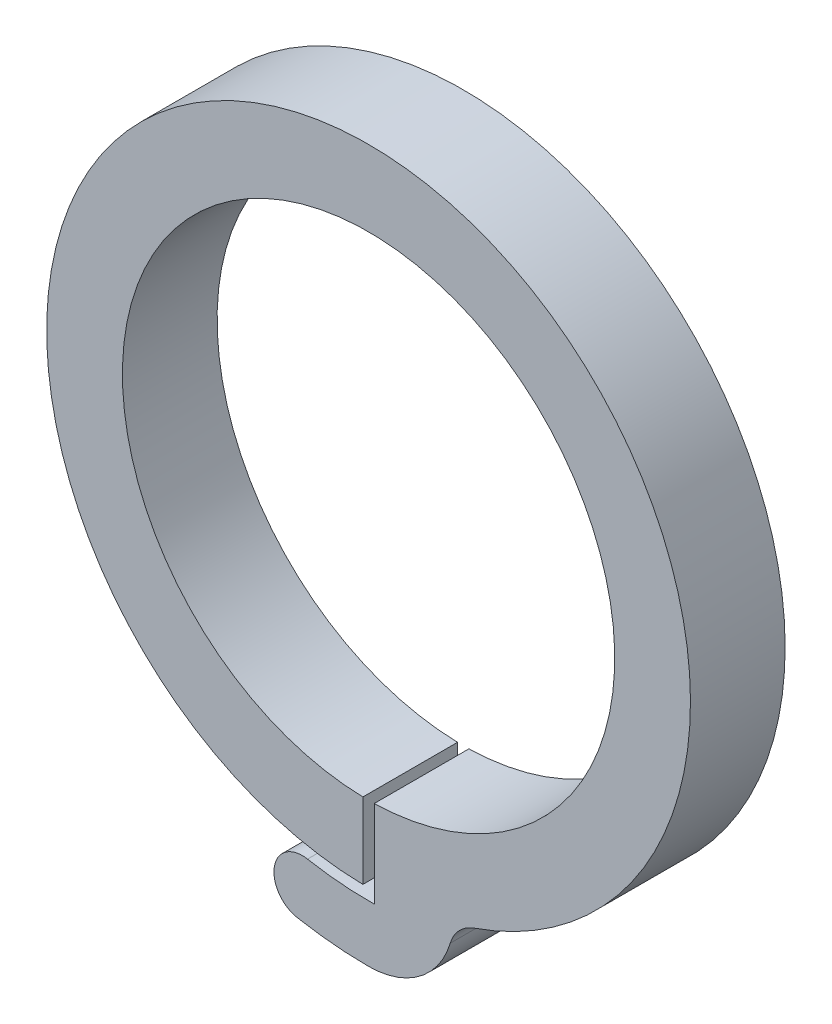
ISO-10303-21;
HEADER;
FILE_DESCRIPTION(('STEP AP214'),'2;1');
FILE_NAME('part.step','',(''),(''),'','','');
FILE_SCHEMA(('AUTOMOTIVE_DESIGN { 1 0 10303 214 1 1 1 1 }'));
ENDSEC;
DATA;
#1=APPLICATION_CONTEXT('core data for automotive mechanical design processes');
#2=APPLICATION_PROTOCOL_DEFINITION('international standard','automotive_design',2000,#1);
#3=PRODUCT_CONTEXT('',#1,'mechanical');
#4=PRODUCT('Part','Part','',(#3));
#5=PRODUCT_RELATED_PRODUCT_CATEGORY('part','',(#4));
#6=PRODUCT_DEFINITION_FORMATION('','',#4);
#7=PRODUCT_DEFINITION_CONTEXT('part definition',#1,'design');
#8=PRODUCT_DEFINITION('design','',#6,#7);
#9=PRODUCT_DEFINITION_SHAPE('','',#8);
#10=(LENGTH_UNIT() NAMED_UNIT(*) SI_UNIT(.MILLI.,.METRE.));
#11=(NAMED_UNIT(*) PLANE_ANGLE_UNIT() SI_UNIT($,.RADIAN.));
#12=(NAMED_UNIT(*) SI_UNIT($,.STERADIAN.) SOLID_ANGLE_UNIT());
#13=UNCERTAINTY_MEASURE_WITH_UNIT(LENGTH_MEASURE(1.E-05),#10,'distance_accuracy_value','');
#14=(GEOMETRIC_REPRESENTATION_CONTEXT(3) GLOBAL_UNCERTAINTY_ASSIGNED_CONTEXT((#13)) GLOBAL_UNIT_ASSIGNED_CONTEXT((#10,
#11,#12)) REPRESENTATION_CONTEXT('',''));
#15=CARTESIAN_POINT('',(0.,0.,0.));
#16=DIRECTION('',(0.,0.,1.));
#17=DIRECTION('',(1.,0.,0.));
#18=AXIS2_PLACEMENT_3D('',#15,#16,#17);
#19=CARTESIAN_POINT('',(-3.5,-18.7743601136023,2.5));
#20=DIRECTION('',(0.,0.,-1.));
#21=DIRECTION('',(-1.,0.,0.));
#22=AXIS2_PLACEMENT_3D('',#19,#20,#21);
#23=CYLINDRICAL_SURFACE('',#22,1.49872143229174);
#24=CARTESIAN_POINT('',(-3.5,-18.7743601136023,-2.5));
#25=DIRECTION('',(0.,0.,1.));
#26=DIRECTION('',(1.,0.,0.));
#27=AXIS2_PLACEMENT_3D('',#24,#25,#26);
#28=CIRCLE('',#27,1.49872143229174);
#29=CARTESIAN_POINT('',(-3.2253337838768,-17.3010222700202,-2.5));
#30=VERTEX_POINT('',#29);
#31=CARTESIAN_POINT('',(-3.77466621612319,-20.2476979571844,-2.5));
#32=VERTEX_POINT('',#31);
#33=EDGE_CURVE('E134',#30,#32,#28,.T.);
#34=ORIENTED_EDGE('',*,*,#33,.T.);
#35=DIRECTION('',(0.,0.,-1.));
#36=VECTOR('',#35,1.);
#37=CARTESIAN_POINT('',(-3.77466621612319,-20.2476979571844,2.5));
#38=LINE('',#37,#36);
#39=CARTESIAN_POINT('',(-3.77466621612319,-20.2476979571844,2.5));
#40=VERTEX_POINT('',#39);
#41=EDGE_CURVE('E11',#40,#32,#38,.T.);
#42=ORIENTED_EDGE('',*,*,#41,.F.);
#43=CARTESIAN_POINT('',(-3.5,-18.7743601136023,2.5));
#44=DIRECTION('',(0.,0.,1.));
#45=DIRECTION('',(1.,0.,0.));
#46=AXIS2_PLACEMENT_3D('',#43,#44,#45);
#47=CIRCLE('',#46,1.49872143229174);
#48=CARTESIAN_POINT('',(-3.2253337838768,-17.3010222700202,2.5));
#49=VERTEX_POINT('',#48);
#50=EDGE_CURVE('E150',#49,#40,#47,.T.);
#51=ORIENTED_EDGE('',*,*,#50,.F.);
#52=DIRECTION('',(0.,0.,-1.));
#53=VECTOR('',#52,1.);
#54=CARTESIAN_POINT('',(-3.2253337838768,-17.3010222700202,2.5));
#55=LINE('',#54,#53);
#56=EDGE_CURVE('E130',#49,#30,#55,.T.);
#57=ORIENTED_EDGE('',*,*,#56,.T.);
#58=EDGE_LOOP('',(#34,#42,#51,#57));
#59=FACE_BOUND('',#58,.T.);
#60=ADVANCED_FACE('F32',(#59),#23,.T.);
#61=CARTESIAN_POINT('',(0.,0.,2.5));
#62=DIRECTION('',(0.,0.,-1.));
#63=DIRECTION('',(-1.,0.,0.));
#64=AXIS2_PLACEMENT_3D('',#61,#62,#63);
#65=CYLINDRICAL_SURFACE('',#64,20.59653800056);
#66=CARTESIAN_POINT('',(0.,0.,-2.5));
#67=DIRECTION('',(0.,0.,1.));
#68=DIRECTION('',(-1.,0.,0.));
#69=AXIS2_PLACEMENT_3D('',#66,#67,#68);
#70=CIRCLE('',#69,20.59653800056);
#71=CARTESIAN_POINT('',(0.,-20.59653800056,-2.5));
#72=VERTEX_POINT('',#71);
#73=EDGE_CURVE('E137',#32,#72,#70,.T.);
#74=ORIENTED_EDGE('',*,*,#73,.T.);
#75=DIRECTION('',(0.,0.,-1.));
#76=VECTOR('',#75,1.);
#77=CARTESIAN_POINT('',(0.,-20.59653800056,2.5));
#78=LINE('',#77,#76);
#79=CARTESIAN_POINT('',(0.,-20.59653800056,2.5));
#80=VERTEX_POINT('',#79);
#81=EDGE_CURVE('E40',#80,#72,#78,.T.);
#82=ORIENTED_EDGE('',*,*,#81,.F.);
#83=CARTESIAN_POINT('',(0.,0.,2.5));
#84=DIRECTION('',(0.,0.,1.));
#85=DIRECTION('',(-1.,0.,0.));
#86=AXIS2_PLACEMENT_3D('',#83,#84,#85);
#87=CIRCLE('',#86,20.59653800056);
#88=EDGE_CURVE('E94',#40,#80,#87,.T.);
#89=ORIENTED_EDGE('',*,*,#88,.F.);
#90=ORIENTED_EDGE('',*,*,#41,.T.);
#91=EDGE_LOOP('',(#74,#82,#89,#90));
#92=FACE_BOUND('',#91,.T.);
#93=ADVANCED_FACE('F193',(#92),#65,.T.);
#94=CARTESIAN_POINT('',(0.,-16.09653800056,2.5));
#95=DIRECTION('',(0.,0.,-1.));
#96=DIRECTION('',(-1.,0.,0.));
#97=AXIS2_PLACEMENT_3D('',#94,#95,#96);
#98=CYLINDRICAL_SURFACE('',#97,4.5);
#99=CARTESIAN_POINT('',(0.,-16.09653800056,-2.5));
#100=DIRECTION('',(0.,0.,1.));
#101=DIRECTION('',(-1.,0.,0.));
#102=AXIS2_PLACEMENT_3D('',#99,#100,#101);
#103=CIRCLE('',#102,4.5);
#104=CARTESIAN_POINT('',(4.31328563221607,-17.3793345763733,-2.5));
#105=VERTEX_POINT('',#104);
#106=EDGE_CURVE('E139',#72,#105,#103,.T.);
#107=ORIENTED_EDGE('',*,*,#106,.T.);
#108=DIRECTION('',(0.,0.,-1.));
#109=VECTOR('',#108,1.);
#110=CARTESIAN_POINT('',(4.31328563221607,-17.3793345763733,2.5));
#111=LINE('',#110,#109);
#112=CARTESIAN_POINT('',(4.31328563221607,-17.3793345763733,2.5));
#113=VERTEX_POINT('',#112);
#114=EDGE_CURVE('E160',#113,#105,#111,.T.);
#115=ORIENTED_EDGE('',*,*,#114,.F.);
#116=CARTESIAN_POINT('',(0.,-16.09653800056,2.5));
#117=DIRECTION('',(0.,0.,1.));
#118=DIRECTION('',(-1.,0.,0.));
#119=AXIS2_PLACEMENT_3D('',#116,#117,#118);
#120=CIRCLE('',#119,4.5);
#121=EDGE_CURVE('E168',#80,#113,#120,.T.);
#122=ORIENTED_EDGE('',*,*,#121,.F.);
#123=ORIENTED_EDGE('',*,*,#81,.T.);
#124=EDGE_LOOP('',(#107,#115,#122,#123));
#125=FACE_BOUND('',#124,.T.);
#126=ADVANCED_FACE('F166',(#125),#98,.T.);
#127=CARTESIAN_POINT('',(6.23030146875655,-17.9494663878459,2.5));
#128=DIRECTION('',(0.,0.,-1.));
#129=DIRECTION('',(-1.,0.,0.));
#130=AXIS2_PLACEMENT_3D('',#127,#128,#129);
#131=CYLINDRICAL_SURFACE('',#130,2.);
#132=CARTESIAN_POINT('',(6.23030146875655,-17.9494663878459,-2.5));
#133=DIRECTION('',(0.,0.,-1.));
#134=DIRECTION('',(-1.,0.,0.));
#135=AXIS2_PLACEMENT_3D('',#132,#133,#134);
#136=CIRCLE('',#135,2.);
#137=CARTESIAN_POINT('',(5.57448026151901,-16.0600488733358,-2.5));
#138=VERTEX_POINT('',#137);
#139=EDGE_CURVE('E141',#105,#138,#136,.T.);
#140=ORIENTED_EDGE('',*,*,#139,.T.);
#141=DIRECTION('',(0.,0.,-1.));
#142=VECTOR('',#141,1.);
#143=CARTESIAN_POINT('',(5.57448026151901,-16.0600488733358,2.5));
#144=LINE('',#143,#142);
#145=CARTESIAN_POINT('',(5.57448026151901,-16.0600488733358,2.5));
#146=VERTEX_POINT('',#145);
#147=EDGE_CURVE('E157',#146,#138,#144,.T.);
#148=ORIENTED_EDGE('',*,*,#147,.F.);
#149=CARTESIAN_POINT('',(6.23030146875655,-17.9494663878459,2.5));
#150=DIRECTION('',(0.,0.,-1.));
#151=DIRECTION('',(-1.,0.,0.));
#152=AXIS2_PLACEMENT_3D('',#149,#150,#151);
#153=CIRCLE('',#152,2.);
#154=EDGE_CURVE('E184',#113,#146,#153,.T.);
#155=ORIENTED_EDGE('',*,*,#154,.F.);
#156=ORIENTED_EDGE('',*,*,#114,.T.);
#157=EDGE_LOOP('',(#140,#148,#155,#156));
#158=FACE_BOUND('',#157,.T.);
#159=ADVANCED_FACE('F177',(#158),#131,.F.);
#160=CARTESIAN_POINT('',(0.,0.,2.5));
#161=DIRECTION('',(0.,0.,-1.));
#162=DIRECTION('',(-1.,0.,0.));
#163=AXIS2_PLACEMENT_3D('',#160,#161,#162);
#164=CYLINDRICAL_SURFACE('',#163,17.);
#165=CARTESIAN_POINT('',(0.,0.,-2.5));
#166=DIRECTION('',(0.,0.,1.));
#167=DIRECTION('',(-1.,0.,0.));
#168=AXIS2_PLACEMENT_3D('',#165,#166,#167);
#169=CIRCLE('',#168,17.);
#170=CARTESIAN_POINT('',(-0.3,-16.9973527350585,-2.5));
#171=VERTEX_POINT('',#170);
#172=EDGE_CURVE('E143',#138,#171,#169,.T.);
#173=ORIENTED_EDGE('',*,*,#172,.T.);
#174=DIRECTION('',(0.,0.,-1.));
#175=VECTOR('',#174,1.);
#176=CARTESIAN_POINT('',(-0.3,-16.9973527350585,2.5));
#177=LINE('',#176,#175);
#178=CARTESIAN_POINT('',(-0.3,-16.9973527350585,2.5));
#179=VERTEX_POINT('',#178);
#180=EDGE_CURVE('E154',#179,#171,#177,.T.);
#181=ORIENTED_EDGE('',*,*,#180,.F.);
#182=CARTESIAN_POINT('',(0.,0.,2.5));
#183=DIRECTION('',(0.,0.,1.));
#184=DIRECTION('',(-1.,0.,0.));
#185=AXIS2_PLACEMENT_3D('',#182,#183,#184);
#186=CIRCLE('',#185,17.);
#187=EDGE_CURVE('E183',#146,#179,#186,.T.);
#188=ORIENTED_EDGE('',*,*,#187,.F.);
#189=ORIENTED_EDGE('',*,*,#147,.T.);
#190=EDGE_LOOP('',(#173,#181,#188,#189));
#191=FACE_BOUND('',#190,.T.);
#192=ADVANCED_FACE('F181',(#191),#164,.T.);
#193=CARTESIAN_POINT('',(-0.3,-12.99653800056,2.5));
#194=DIRECTION('',(-1.,0.,0.));
#195=DIRECTION('',(0.,-1.,0.));
#196=AXIS2_PLACEMENT_3D('',#193,#194,#195);
#197=PLANE('',#196);
#198=DIRECTION('',(0.,1.,0.));
#199=VECTOR('',#198,1.);
#200=CARTESIAN_POINT('',(-0.3,-12.99653800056,-2.5));
#201=LINE('',#200,#199);
#202=CARTESIAN_POINT('',(-0.300000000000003,-12.99653800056,-2.5));
#203=VERTEX_POINT('',#202);
#204=EDGE_CURVE('E145',#171,#203,#201,.T.);
#205=ORIENTED_EDGE('',*,*,#204,.T.);
#206=DIRECTION('',(0.,0.,-1.));
#207=VECTOR('',#206,1.);
#208=CARTESIAN_POINT('',(-0.300000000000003,-12.99653800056,2.5));
#209=LINE('',#208,#207);
#210=CARTESIAN_POINT('',(-0.300000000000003,-12.99653800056,2.5));
#211=VERTEX_POINT('',#210);
#212=EDGE_CURVE('E125',#211,#203,#209,.T.);
#213=ORIENTED_EDGE('',*,*,#212,.F.);
#214=DIRECTION('',(0.,1.,0.));
#215=VECTOR('',#214,1.);
#216=CARTESIAN_POINT('',(-0.3,-12.99653800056,2.5));
#217=LINE('',#216,#215);
#218=EDGE_CURVE('E116',#179,#211,#217,.T.);
#219=ORIENTED_EDGE('',*,*,#218,.F.);
#220=ORIENTED_EDGE('',*,*,#180,.T.);
#221=EDGE_LOOP('',(#205,#213,#219,#220));
#222=FACE_BOUND('',#221,.T.);
#223=ADVANCED_FACE('F205',(#222),#197,.F.);
#224=CARTESIAN_POINT('',(0.,0.,2.5));
#225=DIRECTION('',(0.,0.,-1.));
#226=DIRECTION('',(-1.,0.,0.));
#227=AXIS2_PLACEMENT_3D('',#224,#225,#226);
#228=CYLINDRICAL_SURFACE('',#227,13.);
#229=CARTESIAN_POINT('',(0.,0.,-2.5));
#230=DIRECTION('',(0.,0.,-1.));
#231=DIRECTION('',(-1.,0.,0.));
#232=AXIS2_PLACEMENT_3D('',#229,#230,#231);
#233=CIRCLE('',#232,13.);
#234=CARTESIAN_POINT('',(0.3,-12.99653800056,-2.5));
#235=VERTEX_POINT('',#234);
#236=EDGE_CURVE('E124',#203,#235,#233,.T.);
#237=ORIENTED_EDGE('',*,*,#236,.T.);
#238=DIRECTION('',(0.,0.,-1.));
#239=VECTOR('',#238,1.);
#240=CARTESIAN_POINT('',(0.3,-12.99653800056,2.5));
#241=LINE('',#240,#239);
#242=CARTESIAN_POINT('',(0.3,-12.99653800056,2.5));
#243=VERTEX_POINT('',#242);
#244=EDGE_CURVE('E121',#243,#235,#241,.T.);
#245=ORIENTED_EDGE('',*,*,#244,.F.);
#246=CARTESIAN_POINT('',(0.,0.,2.5));
#247=DIRECTION('',(0.,0.,-1.));
#248=DIRECTION('',(-1.,0.,0.));
#249=AXIS2_PLACEMENT_3D('',#246,#247,#248);
#250=CIRCLE('',#249,13.);
#251=EDGE_CURVE('E110',#211,#243,#250,.T.);
#252=ORIENTED_EDGE('',*,*,#251,.F.);
#253=ORIENTED_EDGE('',*,*,#212,.T.);
#254=EDGE_LOOP('',(#237,#245,#252,#253));
#255=FACE_BOUND('',#254,.T.);
#256=ADVANCED_FACE('F122',(#255),#228,.F.);
#257=CARTESIAN_POINT('',(0.3,-12.99653800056,2.5));
#258=DIRECTION('',(1.,0.,0.));
#259=DIRECTION('',(0.,1.,0.));
#260=AXIS2_PLACEMENT_3D('',#257,#258,#259);
#261=PLANE('',#260);
#262=DIRECTION('',(0.,-1.,0.));
#263=VECTOR('',#262,1.);
#264=CARTESIAN_POINT('',(0.3,-12.99653800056,-2.5));
#265=LINE('',#264,#263);
#266=CARTESIAN_POINT('',(0.299999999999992,-17.59653800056,-2.5));
#267=VERTEX_POINT('',#266);
#268=EDGE_CURVE('E80',#235,#267,#265,.T.);
#269=ORIENTED_EDGE('',*,*,#268,.T.);
#270=DIRECTION('',(0.,0.,-1.));
#271=VECTOR('',#270,1.);
#272=CARTESIAN_POINT('',(0.299999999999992,-17.59653800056,2.5));
#273=LINE('',#272,#271);
#274=CARTESIAN_POINT('',(0.299999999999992,-17.59653800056,2.5));
#275=VERTEX_POINT('',#274);
#276=EDGE_CURVE('E126',#275,#267,#273,.T.);
#277=ORIENTED_EDGE('',*,*,#276,.F.);
#278=DIRECTION('',(0.,-1.,0.));
#279=VECTOR('',#278,1.);
#280=CARTESIAN_POINT('',(0.3,-12.99653800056,2.5));
#281=LINE('',#280,#279);
#282=EDGE_CURVE('E114',#243,#275,#281,.T.);
#283=ORIENTED_EDGE('',*,*,#282,.F.);
#284=ORIENTED_EDGE('',*,*,#244,.T.);
#285=EDGE_LOOP('',(#269,#277,#283,#284));
#286=FACE_BOUND('',#285,.T.);
#287=ADVANCED_FACE('F128',(#286),#261,.F.);
#288=CARTESIAN_POINT('',(0.,0.,2.5));
#289=DIRECTION('',(0.,0.,-1.));
#290=DIRECTION('',(-1.,0.,0.));
#291=AXIS2_PLACEMENT_3D('',#288,#289,#290);
#292=CYLINDRICAL_SURFACE('',#291,17.5990951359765);
#293=CARTESIAN_POINT('',(0.,0.,-2.5));
#294=DIRECTION('',(0.,0.,-1.));
#295=DIRECTION('',(1.,0.,0.));
#296=AXIS2_PLACEMENT_3D('',#293,#294,#295);
#297=CIRCLE('',#296,17.5990951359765);
#298=EDGE_CURVE('E86',#267,#30,#297,.T.);
#299=ORIENTED_EDGE('',*,*,#298,.T.);
#300=ORIENTED_EDGE('',*,*,#56,.F.);
#301=CARTESIAN_POINT('',(0.,0.,2.5));
#302=DIRECTION('',(0.,0.,-1.));
#303=DIRECTION('',(1.,0.,0.));
#304=AXIS2_PLACEMENT_3D('',#301,#302,#303);
#305=CIRCLE('',#304,17.5990951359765);
#306=EDGE_CURVE('E48',#275,#49,#305,.T.);
#307=ORIENTED_EDGE('',*,*,#306,.F.);
#308=ORIENTED_EDGE('',*,*,#276,.T.);
#309=EDGE_LOOP('',(#299,#300,#307,#308));
#310=FACE_BOUND('',#309,.T.);
#311=ADVANCED_FACE('F213',(#310),#292,.F.);
#312=CARTESIAN_POINT('',(-3.5,-18.7743601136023,2.5));
#313=DIRECTION('',(0.,0.,1.));
#314=DIRECTION('',(1.,0.,0.));
#315=AXIS2_PLACEMENT_3D('',#312,#313,#314);
#316=PLANE('',#315);
#317=ORIENTED_EDGE('',*,*,#50,.T.);
#318=ORIENTED_EDGE('',*,*,#88,.T.);
#319=ORIENTED_EDGE('',*,*,#121,.T.);
#320=ORIENTED_EDGE('',*,*,#154,.T.);
#321=ORIENTED_EDGE('',*,*,#187,.T.);
#322=ORIENTED_EDGE('',*,*,#218,.T.);
#323=ORIENTED_EDGE('',*,*,#251,.T.);
#324=ORIENTED_EDGE('',*,*,#282,.T.);
#325=ORIENTED_EDGE('',*,*,#306,.T.);
#326=EDGE_LOOP('',(#317,#318,#319,#320,#321,#322,#323,#324,#325));
#327=FACE_BOUND('',#326,.T.);
#328=ADVANCED_FACE('F112',(#327),#316,.T.);
#329=CARTESIAN_POINT('',(-3.5,-18.7743601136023,-2.5));
#330=DIRECTION('',(0.,0.,1.));
#331=DIRECTION('',(1.,0.,0.));
#332=AXIS2_PLACEMENT_3D('',#329,#330,#331);
#333=PLANE('',#332);
#334=ORIENTED_EDGE('',*,*,#33,.F.);
#335=ORIENTED_EDGE('',*,*,#298,.F.);
#336=ORIENTED_EDGE('',*,*,#268,.F.);
#337=ORIENTED_EDGE('',*,*,#236,.F.);
#338=ORIENTED_EDGE('',*,*,#204,.F.);
#339=ORIENTED_EDGE('',*,*,#172,.F.);
#340=ORIENTED_EDGE('',*,*,#139,.F.);
#341=ORIENTED_EDGE('',*,*,#106,.F.);
#342=ORIENTED_EDGE('',*,*,#73,.F.);
#343=EDGE_LOOP('',(#334,#335,#336,#337,#338,#339,#340,#341,#342));
#344=FACE_BOUND('',#343,.T.);
#345=ADVANCED_FACE('F172',(#344),#333,.F.);
#346=CLOSED_SHELL('',(#60,#93,#126,#159,#192,#223,#256,#287,#311,#328,#345));
#347=MANIFOLD_SOLID_BREP('B2',#346);
#348=ADVANCED_BREP_SHAPE_REPRESENTATION('',(#18,#347),#14);
#349=SHAPE_DEFINITION_REPRESENTATION(#9,#348);
ENDSEC;
END-ISO-10303-21;
